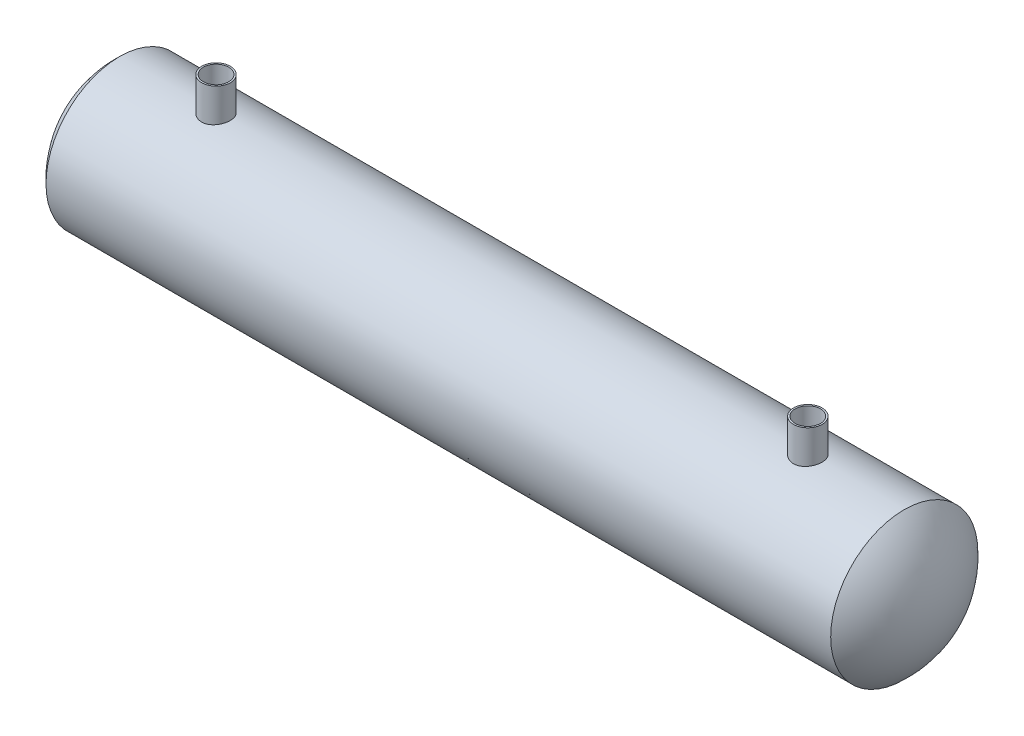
from build123d import *

# Parameters (mm, degrees)
CROQUIS3_R              = 15.5
CORTAR_EXTRUIR1_DEPTH   = 160
CROQUIS4_R              = 17.5
CROQUIS4_R_2            = 15.5
SALIENTE_EXTRUIR1_DEPTH = 50


with BuildPart() as part:
    # Croquis2 → Revoluci_n1 (revolve)
    with BuildSketch(Plane(origin=(0, 0, 0), x_dir=(1, 0, 0), z_dir=(0, 1, 0))):
        with BuildLine():
            Line((-104.846097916, 0), (-101.846097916, 0))
            ThreePointArc((-101.846097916, 0), (-92.211863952, 47.270498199), (-64.846097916, 87))
            Line((-64.846097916, 87), (895.153902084, 87))
            ThreePointArc((895.153902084, 87), (922.51966812, 47.270498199), (932.153902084, 0))
            Line((932.153902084, 0), (935.153902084, 0))
            ThreePointArc((935.153902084, 0), (924.703552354, 49.244289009), (895.153902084, 90))
            Line((895.153902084, 90), (-64.846097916, 90))
            ThreePointArc((-64.846097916, 90), (-94.395748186, 49.244289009), (-104.846097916, 0))
        make_face()
    revolve(axis=Axis((-104.846097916, 0, 0), (1, 0, 0)))

    # Croquis3 → Cortar-Extruir1 (cut)
    with BuildSketch(Plane(origin=(0, 0, 0), x_dir=(1, 0, 0), z_dir=(0, 1, 0))):
        with Locations(Location((53.153902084, 0, 0), (0, 0, 90))):
            Circle(CROQUIS3_R)
        with Locations(Location((777.153902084, 0, 0), (0, 0, 90))):
            Circle(CROQUIS3_R)
    extrude(amount=CORTAR_EXTRUIR1_DEPTH, mode=Mode.SUBTRACT)

    # Croquis4 → Saliente-Extruir1 (add)
    # profile 1 of 2: a face of its own
    with BuildSketch(Plane(origin=(0, 80, 0), x_dir=(-1, 0, 0), z_dir=(0, 1, 0))):
        with Locations(Location((-777.153902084, 0, 0), (0, 0, 270))):
            Circle(CROQUIS4_R)
        with Locations(Location((-777.153902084, 0, 0), (0, 0, 90))):
            Circle(CROQUIS4_R_2, mode=Mode.SUBTRACT)
    # profile 2 of 2: a face of its own
    with BuildSketch(Plane(origin=(0, 80, 0), x_dir=(-1, 0, 0), z_dir=(0, 1, 0))):
        with Locations(Location((-53.153902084, 0, 0), (0, 0, 270))):
            Circle(CROQUIS4_R)
        with Locations(Location((-53.153902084, 0, 0), (0, 0, 90))):
            Circle(CROQUIS4_R_2, mode=Mode.SUBTRACT)
    extrude(amount=SALIENTE_EXTRUIR1_DEPTH)


solid = part.part
